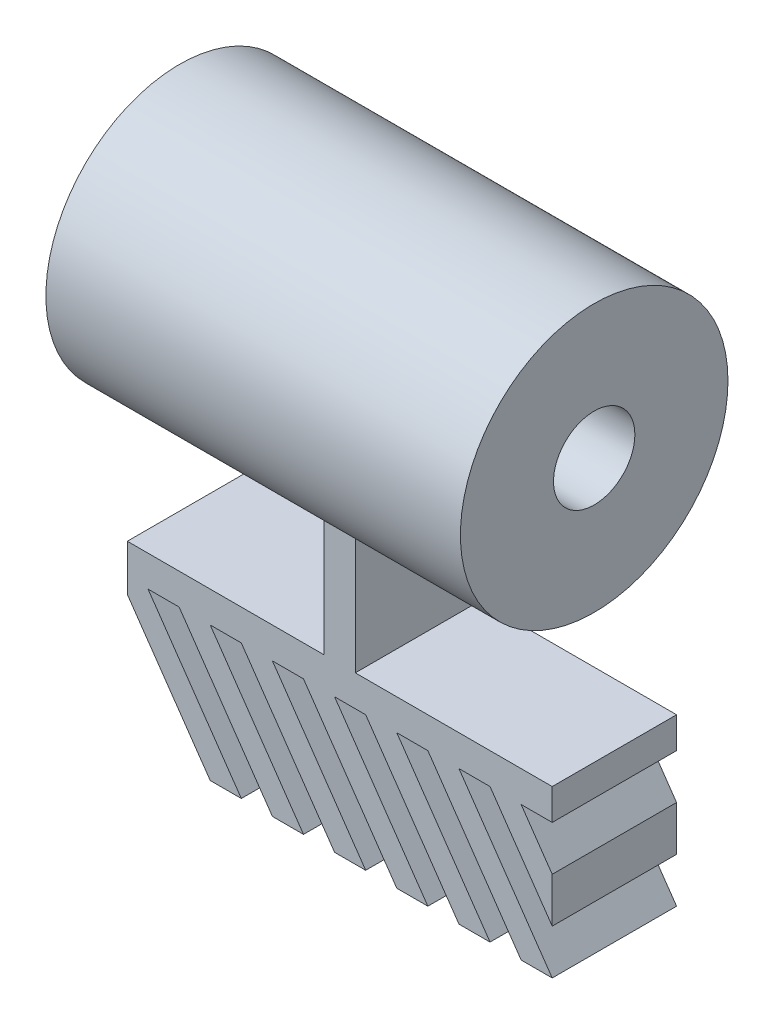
ISO-10303-21;
HEADER;
FILE_DESCRIPTION(('STEP AP214'),'2;1');
FILE_NAME('part.step','',(''),(''),'','','');
FILE_SCHEMA(('AUTOMOTIVE_DESIGN { 1 0 10303 214 1 1 1 1 }'));
ENDSEC;
DATA;
#1=APPLICATION_CONTEXT('core data for automotive mechanical design processes');
#2=APPLICATION_PROTOCOL_DEFINITION('international standard','automotive_design',2000,#1);
#3=PRODUCT_CONTEXT('',#1,'mechanical');
#4=PRODUCT('Part','Part','',(#3));
#5=PRODUCT_RELATED_PRODUCT_CATEGORY('part','',(#4));
#6=PRODUCT_DEFINITION_FORMATION('','',#4);
#7=PRODUCT_DEFINITION_CONTEXT('part definition',#1,'design');
#8=PRODUCT_DEFINITION('design','',#6,#7);
#9=PRODUCT_DEFINITION_SHAPE('','',#8);
#10=(LENGTH_UNIT() NAMED_UNIT(*) SI_UNIT(.MILLI.,.METRE.));
#11=(NAMED_UNIT(*) PLANE_ANGLE_UNIT() SI_UNIT($,.RADIAN.));
#12=(NAMED_UNIT(*) SI_UNIT($,.STERADIAN.) SOLID_ANGLE_UNIT());
#13=UNCERTAINTY_MEASURE_WITH_UNIT(LENGTH_MEASURE(1.E-05),#10,'distance_accuracy_value','');
#14=(GEOMETRIC_REPRESENTATION_CONTEXT(3) GLOBAL_UNCERTAINTY_ASSIGNED_CONTEXT((#13)) GLOBAL_UNIT_ASSIGNED_CONTEXT((#10,
#11,#12)) REPRESENTATION_CONTEXT('',''));
#15=CARTESIAN_POINT('',(0.,0.,0.));
#16=DIRECTION('',(0.,0.,1.));
#17=DIRECTION('',(1.,0.,0.));
#18=AXIS2_PLACEMENT_3D('',#15,#16,#17);
#19=CARTESIAN_POINT('',(-100.,-152.602639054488,0.));
#20=DIRECTION('',(1.,0.,0.));
#21=DIRECTION('',(0.,0.,-1.));
#22=AXIS2_PLACEMENT_3D('',#19,#20,#21);
#23=CYLINDRICAL_SURFACE('',#22,64.5447532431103);
#24=CARTESIAN_POINT('',(14.7507159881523,-152.602639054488,0.));
#25=DIRECTION('',(1.,0.,0.));
#26=DIRECTION('',(0.,1.,0.));
#27=AXIS2_PLACEMENT_3D('',#24,#25,#26);
#28=CIRCLE('',#27,64.5447532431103);
#29=CARTESIAN_POINT('',(14.7507159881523,-209.751787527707,30.));
#30=VERTEX_POINT('',#29);
#31=CARTESIAN_POINT('',(14.7507159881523,-209.751787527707,-30.));
#32=VERTEX_POINT('',#31);
#33=EDGE_CURVE('E256',#30,#32,#28,.T.);
#34=ORIENTED_EDGE('',*,*,#33,.T.);
#35=DIRECTION('',(1.,0.,0.));
#36=VECTOR('',#35,1.);
#37=CARTESIAN_POINT('',(-100.,-209.751787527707,-30.));
#38=LINE('',#37,#36);
#39=CARTESIAN_POINT('',(-0.249284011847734,-209.751787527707,-30.));
#40=VERTEX_POINT('',#39);
#41=EDGE_CURVE('E455',#32,#40,#38,.F.);
#42=ORIENTED_EDGE('',*,*,#41,.T.);
#43=CARTESIAN_POINT('',(-0.249284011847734,-152.602639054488,0.));
#44=DIRECTION('',(-1.,0.,0.));
#45=DIRECTION('',(0.,0.,1.));
#46=AXIS2_PLACEMENT_3D('',#43,#44,#45);
#47=CIRCLE('',#46,64.5447532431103);
#48=CARTESIAN_POINT('',(-0.249284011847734,-209.751787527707,30.));
#49=VERTEX_POINT('',#48);
#50=EDGE_CURVE('E46',#40,#49,#47,.T.);
#51=ORIENTED_EDGE('',*,*,#50,.T.);
#52=DIRECTION('',(1.,0.,0.));
#53=VECTOR('',#52,1.);
#54=CARTESIAN_POINT('',(-100.,-209.751787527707,30.));
#55=LINE('',#54,#53);
#56=EDGE_CURVE('E11',#30,#49,#55,.F.);
#57=ORIENTED_EDGE('',*,*,#56,.F.);
#58=EDGE_LOOP('',(#34,#42,#51,#57));
#59=FACE_BOUND('',#58,.T.);
#60=CARTESIAN_POINT('',(-100.,-152.602639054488,0.));
#61=DIRECTION('',(1.,0.,0.));
#62=DIRECTION('',(0.,0.,-1.));
#63=AXIS2_PLACEMENT_3D('',#60,#61,#62);
#64=CIRCLE('',#63,64.5447532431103);
#65=CARTESIAN_POINT('',(-100.,-152.602639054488,-64.5447532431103));
#66=VERTEX_POINT('',#65);
#67=EDGE_CURVE('E264',#66,#66,#64,.T.);
#68=ORIENTED_EDGE('',*,*,#67,.T.);
#69=EDGE_LOOP('',(#68));
#70=FACE_BOUND('',#69,.T.);
#71=CARTESIAN_POINT('',(100.,-152.602639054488,0.));
#72=DIRECTION('',(1.,0.,0.));
#73=DIRECTION('',(0.,0.,-1.));
#74=AXIS2_PLACEMENT_3D('',#71,#72,#73);
#75=CIRCLE('',#74,64.5447532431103);
#76=CARTESIAN_POINT('',(100.,-152.602639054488,-64.5447532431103));
#77=VERTEX_POINT('',#76);
#78=EDGE_CURVE('E992',#77,#77,#75,.T.);
#79=ORIENTED_EDGE('',*,*,#78,.F.);
#80=EDGE_LOOP('',(#79));
#81=FACE_BOUND('',#80,.T.);
#82=ADVANCED_FACE('F31',(#59,#70,#81),#23,.T.);
#83=CARTESIAN_POINT('',(-100.,-152.602639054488,0.));
#84=DIRECTION('',(1.,0.,0.));
#85=DIRECTION('',(0.,0.,-1.));
#86=AXIS2_PLACEMENT_3D('',#83,#84,#85);
#87=PLANE('',#86);
#88=CARTESIAN_POINT('',(-100.,-152.602639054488,0.));
#89=DIRECTION('',(1.,0.,0.));
#90=DIRECTION('',(0.,0.,-1.));
#91=AXIS2_PLACEMENT_3D('',#88,#89,#90);
#92=CIRCLE('',#91,19.6271342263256);
#93=CARTESIAN_POINT('',(-100.,-152.602639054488,-19.6271342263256));
#94=VERTEX_POINT('',#93);
#95=EDGE_CURVE('E998',#94,#94,#92,.T.);
#96=ORIENTED_EDGE('',*,*,#95,.T.);
#97=EDGE_LOOP('',(#96));
#98=FACE_BOUND('',#97,.T.);
#99=ORIENTED_EDGE('',*,*,#67,.F.);
#100=EDGE_LOOP('',(#99));
#101=FACE_BOUND('',#100,.T.);
#102=ADVANCED_FACE('F673',(#98,#101),#87,.F.);
#103=CARTESIAN_POINT('',(-100.,-152.602639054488,0.));
#104=DIRECTION('',(1.,0.,0.));
#105=DIRECTION('',(0.,0.,-1.));
#106=AXIS2_PLACEMENT_3D('',#103,#104,#105);
#107=CYLINDRICAL_SURFACE('',#106,19.6271342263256);
#108=ORIENTED_EDGE('',*,*,#95,.F.);
#109=EDGE_LOOP('',(#108));
#110=FACE_BOUND('',#109,.T.);
#111=CARTESIAN_POINT('',(100.,-152.602639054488,0.));
#112=DIRECTION('',(1.,0.,0.));
#113=DIRECTION('',(0.,0.,-1.));
#114=AXIS2_PLACEMENT_3D('',#111,#112,#113);
#115=CIRCLE('',#114,19.6271342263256);
#116=CARTESIAN_POINT('',(100.,-152.602639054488,-19.6271342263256));
#117=VERTEX_POINT('',#116);
#118=EDGE_CURVE('E995',#117,#117,#115,.T.);
#119=ORIENTED_EDGE('',*,*,#118,.T.);
#120=EDGE_LOOP('',(#119));
#121=FACE_BOUND('',#120,.T.);
#122=ADVANCED_FACE('F678',(#110,#121),#107,.F.);
#123=CARTESIAN_POINT('',(100.,-152.602639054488,0.));
#124=DIRECTION('',(1.,0.,0.));
#125=DIRECTION('',(0.,0.,-1.));
#126=AXIS2_PLACEMENT_3D('',#123,#124,#125);
#127=PLANE('',#126);
#128=ORIENTED_EDGE('',*,*,#78,.T.);
#129=EDGE_LOOP('',(#128));
#130=FACE_BOUND('',#129,.T.);
#131=ORIENTED_EDGE('',*,*,#118,.F.);
#132=EDGE_LOOP('',(#131));
#133=FACE_BOUND('',#132,.T.);
#134=ADVANCED_FACE('F785',(#130,#133),#127,.T.);
#135=CARTESIAN_POINT('',(-0.249284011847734,-270.00000000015,-30.));
#136=DIRECTION('',(-1.,0.,0.));
#137=DIRECTION('',(0.,0.,1.));
#138=AXIS2_PLACEMENT_3D('',#135,#136,#137);
#139=PLANE('',#138);
#140=ORIENTED_EDGE('',*,*,#50,.F.);
#141=DIRECTION('',(0.,-1.,0.));
#142=VECTOR('',#141,1.);
#143=CARTESIAN_POINT('',(-0.249284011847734,-270.00000000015,-30.));
#144=LINE('',#143,#142);
#145=CARTESIAN_POINT('',(-0.249284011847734,-270.00000000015,-30.));
#146=VERTEX_POINT('',#145);
#147=EDGE_CURVE('E271',#40,#146,#144,.T.);
#148=ORIENTED_EDGE('',*,*,#147,.T.);
#149=DIRECTION('',(0.,0.,1.));
#150=VECTOR('',#149,1.);
#151=CARTESIAN_POINT('',(-0.249284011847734,-270.00000000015,-30.));
#152=LINE('',#151,#150);
#153=CARTESIAN_POINT('',(-0.249284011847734,-270.00000000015,30.));
#154=VERTEX_POINT('',#153);
#155=EDGE_CURVE('E375',#146,#154,#152,.T.);
#156=ORIENTED_EDGE('',*,*,#155,.T.);
#157=DIRECTION('',(0.,-1.,0.));
#158=VECTOR('',#157,1.);
#159=CARTESIAN_POINT('',(-0.249284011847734,-270.00000000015,30.));
#160=LINE('',#159,#158);
#161=EDGE_CURVE('E442',#49,#154,#160,.T.);
#162=ORIENTED_EDGE('',*,*,#161,.F.);
#163=EDGE_LOOP('',(#140,#148,#156,#162));
#164=FACE_BOUND('',#163,.T.);
#165=ADVANCED_FACE('F33',(#164),#139,.T.);
#166=CARTESIAN_POINT('',(14.7507159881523,-200.00000000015,-30.));
#167=DIRECTION('',(1.,0.,0.));
#168=DIRECTION('',(0.,1.,0.));
#169=AXIS2_PLACEMENT_3D('',#166,#167,#168);
#170=PLANE('',#169);
#171=ORIENTED_EDGE('',*,*,#33,.F.);
#172=DIRECTION('',(0.,1.,0.));
#173=VECTOR('',#172,1.);
#174=CARTESIAN_POINT('',(14.7507159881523,-200.00000000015,30.));
#175=LINE('',#174,#173);
#176=CARTESIAN_POINT('',(14.7507159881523,-270.00000000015,30.));
#177=VERTEX_POINT('',#176);
#178=EDGE_CURVE('E262',#177,#30,#175,.T.);
#179=ORIENTED_EDGE('',*,*,#178,.F.);
#180=DIRECTION('',(0.,0.,1.));
#181=VECTOR('',#180,1.);
#182=CARTESIAN_POINT('',(14.7507159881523,-270.00000000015,-30.));
#183=LINE('',#182,#181);
#184=CARTESIAN_POINT('',(14.7507159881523,-270.00000000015,-30.));
#185=VERTEX_POINT('',#184);
#186=EDGE_CURVE('E39',#185,#177,#183,.T.);
#187=ORIENTED_EDGE('',*,*,#186,.F.);
#188=DIRECTION('',(0.,1.,0.));
#189=VECTOR('',#188,1.);
#190=CARTESIAN_POINT('',(14.7507159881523,-200.00000000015,-30.));
#191=LINE('',#190,#189);
#192=EDGE_CURVE('E263',#185,#32,#191,.T.);
#193=ORIENTED_EDGE('',*,*,#192,.T.);
#194=EDGE_LOOP('',(#171,#179,#187,#193));
#195=FACE_BOUND('',#194,.T.);
#196=ADVANCED_FACE('F261',(#195),#170,.T.);
#197=CARTESIAN_POINT('',(14.7507159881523,-270.00000000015,-30.));
#198=DIRECTION('',(0.,1.,0.));
#199=DIRECTION('',(0.,0.,1.));
#200=AXIS2_PLACEMENT_3D('',#197,#198,#199);
#201=PLANE('',#200);
#202=ORIENTED_EDGE('',*,*,#186,.T.);
#203=DIRECTION('',(-1.,0.,0.));
#204=VECTOR('',#203,1.);
#205=CARTESIAN_POINT('',(14.7507159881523,-270.00000000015,30.));
#206=LINE('',#205,#204);
#207=CARTESIAN_POINT('',(109.750715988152,-270.00000000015,30.));
#208=VERTEX_POINT('',#207);
#209=EDGE_CURVE('E270',#208,#177,#206,.T.);
#210=ORIENTED_EDGE('',*,*,#209,.F.);
#211=DIRECTION('',(0.,0.,1.));
#212=VECTOR('',#211,1.);
#213=CARTESIAN_POINT('',(109.750715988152,-270.00000000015,-30.));
#214=LINE('',#213,#212);
#215=CARTESIAN_POINT('',(109.750715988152,-270.00000000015,-30.));
#216=VERTEX_POINT('',#215);
#217=EDGE_CURVE('E377',#216,#208,#214,.T.);
#218=ORIENTED_EDGE('',*,*,#217,.F.);
#219=DIRECTION('',(-1.,0.,0.));
#220=VECTOR('',#219,1.);
#221=CARTESIAN_POINT('',(14.7507159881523,-270.00000000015,-30.));
#222=LINE('',#221,#220);
#223=EDGE_CURVE('E371',#216,#185,#222,.T.);
#224=ORIENTED_EDGE('',*,*,#223,.T.);
#225=EDGE_LOOP('',(#202,#210,#218,#224));
#226=FACE_BOUND('',#225,.T.);
#227=ADVANCED_FACE('F545',(#226),#201,.T.);
#228=CARTESIAN_POINT('',(109.750715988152,-270.00000000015,-30.));
#229=DIRECTION('',(1.,0.,0.));
#230=DIRECTION('',(0.,0.,-1.));
#231=AXIS2_PLACEMENT_3D('',#228,#229,#230);
#232=PLANE('',#231);
#233=ORIENTED_EDGE('',*,*,#217,.T.);
#234=DIRECTION('',(0.,1.,0.));
#235=VECTOR('',#234,1.);
#236=CARTESIAN_POINT('',(109.750715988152,-270.00000000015,30.));
#237=LINE('',#236,#235);
#238=CARTESIAN_POINT('',(109.750715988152,-285.00000000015,30.));
#239=VERTEX_POINT('',#238);
#240=EDGE_CURVE('E275',#239,#208,#237,.T.);
#241=ORIENTED_EDGE('',*,*,#240,.F.);
#242=DIRECTION('',(0.,0.,1.));
#243=VECTOR('',#242,1.);
#244=CARTESIAN_POINT('',(109.750715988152,-285.00000000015,-30.));
#245=LINE('',#244,#243);
#246=CARTESIAN_POINT('',(109.750715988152,-285.00000000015,-30.));
#247=VERTEX_POINT('',#246);
#248=EDGE_CURVE('E379',#247,#239,#245,.T.);
#249=ORIENTED_EDGE('',*,*,#248,.F.);
#250=DIRECTION('',(0.,1.,0.));
#251=VECTOR('',#250,1.);
#252=CARTESIAN_POINT('',(109.750715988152,-270.00000000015,-30.));
#253=LINE('',#252,#251);
#254=EDGE_CURVE('E368',#247,#216,#253,.T.);
#255=ORIENTED_EDGE('',*,*,#254,.T.);
#256=EDGE_LOOP('',(#233,#241,#249,#255));
#257=FACE_BOUND('',#256,.T.);
#258=ADVANCED_FACE('F551',(#257),#232,.T.);
#259=CARTESIAN_POINT('',(109.750715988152,-285.00000000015,-30.));
#260=DIRECTION('',(0.,-1.,0.));
#261=DIRECTION('',(0.,0.,-1.));
#262=AXIS2_PLACEMENT_3D('',#259,#260,#261);
#263=PLANE('',#262);
#264=ORIENTED_EDGE('',*,*,#248,.T.);
#265=DIRECTION('',(1.,0.,0.));
#266=VECTOR('',#265,1.);
#267=CARTESIAN_POINT('',(109.750715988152,-285.00000000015,30.));
#268=LINE('',#267,#266);
#269=CARTESIAN_POINT('',(94.7507159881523,-285.00000000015,30.));
#270=VERTEX_POINT('',#269);
#271=EDGE_CURVE('E539',#270,#239,#268,.T.);
#272=ORIENTED_EDGE('',*,*,#271,.F.);
#273=DIRECTION('',(0.,0.,1.));
#274=VECTOR('',#273,1.);
#275=CARTESIAN_POINT('',(94.7507159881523,-285.00000000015,-30.));
#276=LINE('',#275,#274);
#277=CARTESIAN_POINT('',(94.7507159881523,-285.00000000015,-30.));
#278=VERTEX_POINT('',#277);
#279=EDGE_CURVE('E381',#278,#270,#276,.T.);
#280=ORIENTED_EDGE('',*,*,#279,.F.);
#281=DIRECTION('',(1.,0.,0.));
#282=VECTOR('',#281,1.);
#283=CARTESIAN_POINT('',(109.750715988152,-285.00000000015,-30.));
#284=LINE('',#283,#282);
#285=EDGE_CURVE('E365',#278,#247,#284,.T.);
#286=ORIENTED_EDGE('',*,*,#285,.T.);
#287=EDGE_LOOP('',(#264,#272,#280,#286));
#288=FACE_BOUND('',#287,.T.);
#289=ADVANCED_FACE('F553',(#288),#263,.T.);
#290=CARTESIAN_POINT('',(94.7507159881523,-285.00000000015,-30.));
#291=DIRECTION('',(0.822192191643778,0.569209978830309,0.));
#292=DIRECTION('',(-0.569209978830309,0.822192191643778,0.));
#293=AXIS2_PLACEMENT_3D('',#290,#291,#292);
#294=PLANE('',#293);
#295=ORIENTED_EDGE('',*,*,#279,.T.);
#296=DIRECTION('',(-0.569209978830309,0.822192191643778,0.));
#297=VECTOR('',#296,1.);
#298=CARTESIAN_POINT('',(94.7507159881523,-285.00000000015,30.));
#299=LINE('',#298,#297);
#300=CARTESIAN_POINT('',(109.750715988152,-306.666666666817,30.));
#301=VERTEX_POINT('',#300);
#302=EDGE_CURVE('E536',#301,#270,#299,.T.);
#303=ORIENTED_EDGE('',*,*,#302,.F.);
#304=DIRECTION('',(0.,0.,1.));
#305=VECTOR('',#304,1.);
#306=CARTESIAN_POINT('',(109.750715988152,-306.666666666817,-30.));
#307=LINE('',#306,#305);
#308=CARTESIAN_POINT('',(109.750715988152,-306.666666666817,-30.));
#309=VERTEX_POINT('',#308);
#310=EDGE_CURVE('E383',#309,#301,#307,.T.);
#311=ORIENTED_EDGE('',*,*,#310,.F.);
#312=DIRECTION('',(-0.569209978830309,0.822192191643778,0.));
#313=VECTOR('',#312,1.);
#314=CARTESIAN_POINT('',(94.7507159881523,-285.00000000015,-30.));
#315=LINE('',#314,#313);
#316=EDGE_CURVE('E362',#309,#278,#315,.T.);
#317=ORIENTED_EDGE('',*,*,#316,.T.);
#318=EDGE_LOOP('',(#295,#303,#311,#317));
#319=FACE_BOUND('',#318,.T.);
#320=ADVANCED_FACE('F557',(#319),#294,.T.);
#321=CARTESIAN_POINT('',(109.750715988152,-306.666666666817,-30.));
#322=DIRECTION('',(1.,0.,0.));
#323=DIRECTION('',(0.,0.,-1.));
#324=AXIS2_PLACEMENT_3D('',#321,#322,#323);
#325=PLANE('',#324);
#326=ORIENTED_EDGE('',*,*,#310,.T.);
#327=DIRECTION('',(0.,1.,0.));
#328=VECTOR('',#327,1.);
#329=CARTESIAN_POINT('',(109.750715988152,-306.666666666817,30.));
#330=LINE('',#329,#328);
#331=CARTESIAN_POINT('',(109.750715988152,-328.333333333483,30.));
#332=VERTEX_POINT('',#331);
#333=EDGE_CURVE('E533',#332,#301,#330,.T.);
#334=ORIENTED_EDGE('',*,*,#333,.F.);
#335=DIRECTION('',(0.,0.,1.));
#336=VECTOR('',#335,1.);
#337=CARTESIAN_POINT('',(109.750715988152,-328.333333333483,-30.));
#338=LINE('',#337,#336);
#339=CARTESIAN_POINT('',(109.750715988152,-328.333333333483,-30.));
#340=VERTEX_POINT('',#339);
#341=EDGE_CURVE('E385',#340,#332,#338,.T.);
#342=ORIENTED_EDGE('',*,*,#341,.F.);
#343=DIRECTION('',(0.,1.,0.));
#344=VECTOR('',#343,1.);
#345=CARTESIAN_POINT('',(109.750715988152,-306.666666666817,-30.));
#346=LINE('',#345,#344);
#347=EDGE_CURVE('E359',#340,#309,#346,.T.);
#348=ORIENTED_EDGE('',*,*,#347,.T.);
#349=EDGE_LOOP('',(#326,#334,#342,#348));
#350=FACE_BOUND('',#349,.T.);
#351=ADVANCED_FACE('F561',(#350),#325,.T.);
#352=CARTESIAN_POINT('',(109.750715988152,-328.333333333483,-30.));
#353=DIRECTION('',(-0.822192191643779,-0.569209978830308,0.));
#354=DIRECTION('',(0.569209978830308,-0.822192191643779,0.));
#355=AXIS2_PLACEMENT_3D('',#352,#353,#354);
#356=PLANE('',#355);
#357=ORIENTED_EDGE('',*,*,#341,.T.);
#358=DIRECTION('',(0.569209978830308,-0.822192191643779,0.));
#359=VECTOR('',#358,1.);
#360=CARTESIAN_POINT('',(109.750715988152,-328.333333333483,30.));
#361=LINE('',#360,#359);
#362=CARTESIAN_POINT('',(79.7507159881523,-285.00000000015,30.));
#363=VERTEX_POINT('',#362);
#364=EDGE_CURVE('E530',#363,#332,#361,.T.);
#365=ORIENTED_EDGE('',*,*,#364,.F.);
#366=DIRECTION('',(0.,0.,1.));
#367=VECTOR('',#366,1.);
#368=CARTESIAN_POINT('',(79.7507159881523,-285.00000000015,-30.));
#369=LINE('',#368,#367);
#370=CARTESIAN_POINT('',(79.7507159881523,-285.00000000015,-30.));
#371=VERTEX_POINT('',#370);
#372=EDGE_CURVE('E387',#371,#363,#369,.T.);
#373=ORIENTED_EDGE('',*,*,#372,.F.);
#374=DIRECTION('',(0.569209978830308,-0.822192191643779,0.));
#375=VECTOR('',#374,1.);
#376=CARTESIAN_POINT('',(109.750715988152,-328.333333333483,-30.));
#377=LINE('',#376,#375);
#378=EDGE_CURVE('E356',#371,#340,#377,.T.);
#379=ORIENTED_EDGE('',*,*,#378,.T.);
#380=EDGE_LOOP('',(#357,#365,#373,#379));
#381=FACE_BOUND('',#380,.T.);
#382=ADVANCED_FACE('F565',(#381),#356,.T.);
#383=CARTESIAN_POINT('',(79.7507159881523,-285.00000000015,-30.));
#384=DIRECTION('',(0.,-1.,0.));
#385=DIRECTION('',(0.,0.,-1.));
#386=AXIS2_PLACEMENT_3D('',#383,#384,#385);
#387=PLANE('',#386);
#388=ORIENTED_EDGE('',*,*,#372,.T.);
#389=DIRECTION('',(1.,0.,0.));
#390=VECTOR('',#389,1.);
#391=CARTESIAN_POINT('',(79.7507159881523,-285.00000000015,30.));
#392=LINE('',#391,#390);
#393=CARTESIAN_POINT('',(64.7507159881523,-285.00000000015,30.));
#394=VERTEX_POINT('',#393);
#395=EDGE_CURVE('E527',#394,#363,#392,.T.);
#396=ORIENTED_EDGE('',*,*,#395,.F.);
#397=DIRECTION('',(0.,0.,1.));
#398=VECTOR('',#397,1.);
#399=CARTESIAN_POINT('',(64.7507159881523,-285.00000000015,-30.));
#400=LINE('',#399,#398);
#401=CARTESIAN_POINT('',(64.7507159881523,-285.00000000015,-30.));
#402=VERTEX_POINT('',#401);
#403=EDGE_CURVE('E389',#402,#394,#400,.T.);
#404=ORIENTED_EDGE('',*,*,#403,.F.);
#405=DIRECTION('',(1.,0.,0.));
#406=VECTOR('',#405,1.);
#407=CARTESIAN_POINT('',(79.7507159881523,-285.00000000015,-30.));
#408=LINE('',#407,#406);
#409=EDGE_CURVE('E353',#402,#371,#408,.T.);
#410=ORIENTED_EDGE('',*,*,#409,.T.);
#411=EDGE_LOOP('',(#388,#396,#404,#410));
#412=FACE_BOUND('',#411,.T.);
#413=ADVANCED_FACE('F570',(#412),#387,.T.);
#414=CARTESIAN_POINT('',(64.7507159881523,-285.00000000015,-30.));
#415=DIRECTION('',(0.822192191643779,0.569209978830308,0.));
#416=DIRECTION('',(-0.569209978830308,0.822192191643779,0.));
#417=AXIS2_PLACEMENT_3D('',#414,#415,#416);
#418=PLANE('',#417);
#419=ORIENTED_EDGE('',*,*,#403,.T.);
#420=DIRECTION('',(-0.569209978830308,0.822192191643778,0.));
#421=VECTOR('',#420,1.);
#422=CARTESIAN_POINT('',(64.7507159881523,-285.00000000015,30.));
#423=LINE('',#422,#421);
#424=CARTESIAN_POINT('',(109.750715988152,-350.00000000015,30.));
#425=VERTEX_POINT('',#424);
#426=EDGE_CURVE('E524',#425,#394,#423,.T.);
#427=ORIENTED_EDGE('',*,*,#426,.F.);
#428=DIRECTION('',(0.,0.,1.));
#429=VECTOR('',#428,1.);
#430=CARTESIAN_POINT('',(109.750715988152,-350.00000000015,-30.));
#431=LINE('',#430,#429);
#432=CARTESIAN_POINT('',(109.750715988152,-350.00000000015,-30.));
#433=VERTEX_POINT('',#432);
#434=EDGE_CURVE('E391',#433,#425,#431,.T.);
#435=ORIENTED_EDGE('',*,*,#434,.F.);
#436=DIRECTION('',(-0.569209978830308,0.822192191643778,0.));
#437=VECTOR('',#436,1.);
#438=CARTESIAN_POINT('',(64.7507159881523,-285.00000000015,-30.));
#439=LINE('',#438,#437);
#440=EDGE_CURVE('E350',#433,#402,#439,.T.);
#441=ORIENTED_EDGE('',*,*,#440,.T.);
#442=EDGE_LOOP('',(#419,#427,#435,#441));
#443=FACE_BOUND('',#442,.T.);
#444=ADVANCED_FACE('F573',(#443),#418,.T.);
#445=CARTESIAN_POINT('',(109.750715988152,-350.00000000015,-30.));
#446=DIRECTION('',(0.,-1.,0.));
#447=DIRECTION('',(0.,0.,-1.));
#448=AXIS2_PLACEMENT_3D('',#445,#446,#447);
#449=PLANE('',#448);
#450=ORIENTED_EDGE('',*,*,#434,.T.);
#451=DIRECTION('',(1.,0.,0.));
#452=VECTOR('',#451,1.);
#453=CARTESIAN_POINT('',(109.750715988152,-350.00000000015,30.));
#454=LINE('',#453,#452);
#455=CARTESIAN_POINT('',(94.7507159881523,-350.00000000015,30.));
#456=VERTEX_POINT('',#455);
#457=EDGE_CURVE('E521',#456,#425,#454,.T.);
#458=ORIENTED_EDGE('',*,*,#457,.F.);
#459=DIRECTION('',(0.,0.,1.));
#460=VECTOR('',#459,1.);
#461=CARTESIAN_POINT('',(94.7507159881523,-350.00000000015,-30.));
#462=LINE('',#461,#460);
#463=CARTESIAN_POINT('',(94.7507159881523,-350.00000000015,-30.));
#464=VERTEX_POINT('',#463);
#465=EDGE_CURVE('E393',#464,#456,#462,.T.);
#466=ORIENTED_EDGE('',*,*,#465,.F.);
#467=DIRECTION('',(1.,0.,0.));
#468=VECTOR('',#467,1.);
#469=CARTESIAN_POINT('',(109.750715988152,-350.00000000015,-30.));
#470=LINE('',#469,#468);
#471=EDGE_CURVE('E347',#464,#433,#470,.T.);
#472=ORIENTED_EDGE('',*,*,#471,.T.);
#473=EDGE_LOOP('',(#450,#458,#466,#472));
#474=FACE_BOUND('',#473,.T.);
#475=ADVANCED_FACE('F577',(#474),#449,.T.);
#476=CARTESIAN_POINT('',(94.7507159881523,-350.00000000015,-30.));
#477=DIRECTION('',(-0.822192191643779,-0.569209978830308,0.));
#478=DIRECTION('',(0.569209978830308,-0.822192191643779,0.));
#479=AXIS2_PLACEMENT_3D('',#476,#477,#478);
#480=PLANE('',#479);
#481=ORIENTED_EDGE('',*,*,#465,.T.);
#482=DIRECTION('',(0.569209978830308,-0.822192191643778,0.));
#483=VECTOR('',#482,1.);
#484=CARTESIAN_POINT('',(94.7507159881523,-350.00000000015,30.));
#485=LINE('',#484,#483);
#486=CARTESIAN_POINT('',(49.7507159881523,-285.00000000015,30.));
#487=VERTEX_POINT('',#486);
#488=EDGE_CURVE('E518',#487,#456,#485,.T.);
#489=ORIENTED_EDGE('',*,*,#488,.F.);
#490=DIRECTION('',(0.,0.,1.));
#491=VECTOR('',#490,1.);
#492=CARTESIAN_POINT('',(49.7507159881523,-285.00000000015,-30.));
#493=LINE('',#492,#491);
#494=CARTESIAN_POINT('',(49.7507159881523,-285.00000000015,-30.));
#495=VERTEX_POINT('',#494);
#496=EDGE_CURVE('E395',#495,#487,#493,.T.);
#497=ORIENTED_EDGE('',*,*,#496,.F.);
#498=DIRECTION('',(0.569209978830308,-0.822192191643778,0.));
#499=VECTOR('',#498,1.);
#500=CARTESIAN_POINT('',(94.7507159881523,-350.00000000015,-30.));
#501=LINE('',#500,#499);
#502=EDGE_CURVE('E344',#495,#464,#501,.T.);
#503=ORIENTED_EDGE('',*,*,#502,.T.);
#504=EDGE_LOOP('',(#481,#489,#497,#503));
#505=FACE_BOUND('',#504,.T.);
#506=ADVANCED_FACE('F582',(#505),#480,.T.);
#507=CARTESIAN_POINT('',(49.7507159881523,-285.00000000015,-30.));
#508=DIRECTION('',(0.,-1.,0.));
#509=DIRECTION('',(0.,0.,-1.));
#510=AXIS2_PLACEMENT_3D('',#507,#508,#509);
#511=PLANE('',#510);
#512=ORIENTED_EDGE('',*,*,#496,.T.);
#513=DIRECTION('',(1.,0.,0.));
#514=VECTOR('',#513,1.);
#515=CARTESIAN_POINT('',(49.7507159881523,-285.00000000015,30.));
#516=LINE('',#515,#514);
#517=CARTESIAN_POINT('',(34.7507159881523,-285.00000000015,30.));
#518=VERTEX_POINT('',#517);
#519=EDGE_CURVE('E515',#518,#487,#516,.T.);
#520=ORIENTED_EDGE('',*,*,#519,.F.);
#521=DIRECTION('',(0.,0.,1.));
#522=VECTOR('',#521,1.);
#523=CARTESIAN_POINT('',(34.7507159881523,-285.00000000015,-30.));
#524=LINE('',#523,#522);
#525=CARTESIAN_POINT('',(34.7507159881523,-285.00000000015,-30.));
#526=VERTEX_POINT('',#525);
#527=EDGE_CURVE('E397',#526,#518,#524,.T.);
#528=ORIENTED_EDGE('',*,*,#527,.F.);
#529=DIRECTION('',(1.,0.,0.));
#530=VECTOR('',#529,1.);
#531=CARTESIAN_POINT('',(49.7507159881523,-285.00000000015,-30.));
#532=LINE('',#531,#530);
#533=EDGE_CURVE('E341',#526,#495,#532,.T.);
#534=ORIENTED_EDGE('',*,*,#533,.T.);
#535=EDGE_LOOP('',(#512,#520,#528,#534));
#536=FACE_BOUND('',#535,.T.);
#537=ADVANCED_FACE('F585',(#536),#511,.T.);
#538=CARTESIAN_POINT('',(34.7507159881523,-285.00000000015,-30.));
#539=DIRECTION('',(0.822192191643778,0.569209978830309,0.));
#540=DIRECTION('',(-0.569209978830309,0.822192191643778,0.));
#541=AXIS2_PLACEMENT_3D('',#538,#539,#540);
#542=PLANE('',#541);
#543=ORIENTED_EDGE('',*,*,#527,.T.);
#544=DIRECTION('',(-0.569209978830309,0.822192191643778,0.));
#545=VECTOR('',#544,1.);
#546=CARTESIAN_POINT('',(34.7507159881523,-285.00000000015,30.));
#547=LINE('',#546,#545);
#548=CARTESIAN_POINT('',(79.7507159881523,-350.00000000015,30.));
#549=VERTEX_POINT('',#548);
#550=EDGE_CURVE('E512',#549,#518,#547,.T.);
#551=ORIENTED_EDGE('',*,*,#550,.F.);
#552=DIRECTION('',(0.,0.,1.));
#553=VECTOR('',#552,1.);
#554=CARTESIAN_POINT('',(79.7507159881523,-350.00000000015,-30.));
#555=LINE('',#554,#553);
#556=CARTESIAN_POINT('',(79.7507159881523,-350.00000000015,-30.));
#557=VERTEX_POINT('',#556);
#558=EDGE_CURVE('E399',#557,#549,#555,.T.);
#559=ORIENTED_EDGE('',*,*,#558,.F.);
#560=DIRECTION('',(-0.569209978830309,0.822192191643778,0.));
#561=VECTOR('',#560,1.);
#562=CARTESIAN_POINT('',(34.7507159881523,-285.00000000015,-30.));
#563=LINE('',#562,#561);
#564=EDGE_CURVE('E338',#557,#526,#563,.T.);
#565=ORIENTED_EDGE('',*,*,#564,.T.);
#566=EDGE_LOOP('',(#543,#551,#559,#565));
#567=FACE_BOUND('',#566,.T.);
#568=ADVANCED_FACE('F589',(#567),#542,.T.);
#569=CARTESIAN_POINT('',(79.7507159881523,-350.00000000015,-30.));
#570=DIRECTION('',(0.,-1.,0.));
#571=DIRECTION('',(0.,0.,-1.));
#572=AXIS2_PLACEMENT_3D('',#569,#570,#571);
#573=PLANE('',#572);
#574=ORIENTED_EDGE('',*,*,#558,.T.);
#575=DIRECTION('',(1.,0.,0.));
#576=VECTOR('',#575,1.);
#577=CARTESIAN_POINT('',(79.7507159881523,-350.00000000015,30.));
#578=LINE('',#577,#576);
#579=CARTESIAN_POINT('',(64.7507159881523,-350.00000000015,30.));
#580=VERTEX_POINT('',#579);
#581=EDGE_CURVE('E509',#580,#549,#578,.T.);
#582=ORIENTED_EDGE('',*,*,#581,.F.);
#583=DIRECTION('',(0.,0.,1.));
#584=VECTOR('',#583,1.);
#585=CARTESIAN_POINT('',(64.7507159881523,-350.00000000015,-30.));
#586=LINE('',#585,#584);
#587=CARTESIAN_POINT('',(64.7507159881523,-350.00000000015,-30.));
#588=VERTEX_POINT('',#587);
#589=EDGE_CURVE('E401',#588,#580,#586,.T.);
#590=ORIENTED_EDGE('',*,*,#589,.F.);
#591=DIRECTION('',(1.,0.,0.));
#592=VECTOR('',#591,1.);
#593=CARTESIAN_POINT('',(79.7507159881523,-350.00000000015,-30.));
#594=LINE('',#593,#592);
#595=EDGE_CURVE('E335',#588,#557,#594,.T.);
#596=ORIENTED_EDGE('',*,*,#595,.T.);
#597=EDGE_LOOP('',(#574,#582,#590,#596));
#598=FACE_BOUND('',#597,.T.);
#599=ADVANCED_FACE('F594',(#598),#573,.T.);
#600=CARTESIAN_POINT('',(64.7507159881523,-350.00000000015,-30.));
#601=DIRECTION('',(-0.822192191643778,-0.569209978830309,0.));
#602=DIRECTION('',(0.569209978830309,-0.822192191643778,0.));
#603=AXIS2_PLACEMENT_3D('',#600,#601,#602);
#604=PLANE('',#603);
#605=ORIENTED_EDGE('',*,*,#589,.T.);
#606=DIRECTION('',(0.569209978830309,-0.822192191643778,0.));
#607=VECTOR('',#606,1.);
#608=CARTESIAN_POINT('',(64.7507159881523,-350.00000000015,30.));
#609=LINE('',#608,#607);
#610=CARTESIAN_POINT('',(19.7507159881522,-285.00000000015,30.));
#611=VERTEX_POINT('',#610);
#612=EDGE_CURVE('E506',#611,#580,#609,.T.);
#613=ORIENTED_EDGE('',*,*,#612,.F.);
#614=DIRECTION('',(0.,0.,1.));
#615=VECTOR('',#614,1.);
#616=CARTESIAN_POINT('',(19.7507159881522,-285.00000000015,-30.));
#617=LINE('',#616,#615);
#618=CARTESIAN_POINT('',(19.7507159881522,-285.00000000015,-30.));
#619=VERTEX_POINT('',#618);
#620=EDGE_CURVE('E403',#619,#611,#617,.T.);
#621=ORIENTED_EDGE('',*,*,#620,.F.);
#622=DIRECTION('',(0.569209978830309,-0.822192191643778,0.));
#623=VECTOR('',#622,1.);
#624=CARTESIAN_POINT('',(64.7507159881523,-350.00000000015,-30.));
#625=LINE('',#624,#623);
#626=EDGE_CURVE('E332',#619,#588,#625,.T.);
#627=ORIENTED_EDGE('',*,*,#626,.T.);
#628=EDGE_LOOP('',(#605,#613,#621,#627));
#629=FACE_BOUND('',#628,.T.);
#630=ADVANCED_FACE('F597',(#629),#604,.T.);
#631=CARTESIAN_POINT('',(19.7507159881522,-285.00000000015,-30.));
#632=DIRECTION('',(0.,-1.,0.));
#633=DIRECTION('',(0.,0.,-1.));
#634=AXIS2_PLACEMENT_3D('',#631,#632,#633);
#635=PLANE('',#634);
#636=ORIENTED_EDGE('',*,*,#620,.T.);
#637=DIRECTION('',(1.,0.,0.));
#638=VECTOR('',#637,1.);
#639=CARTESIAN_POINT('',(19.7507159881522,-285.00000000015,30.));
#640=LINE('',#639,#638);
#641=CARTESIAN_POINT('',(4.75071598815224,-285.00000000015,30.));
#642=VERTEX_POINT('',#641);
#643=EDGE_CURVE('E503',#642,#611,#640,.T.);
#644=ORIENTED_EDGE('',*,*,#643,.F.);
#645=DIRECTION('',(0.,0.,1.));
#646=VECTOR('',#645,1.);
#647=CARTESIAN_POINT('',(4.75071598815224,-285.00000000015,-30.));
#648=LINE('',#647,#646);
#649=CARTESIAN_POINT('',(4.75071598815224,-285.00000000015,-30.));
#650=VERTEX_POINT('',#649);
#651=EDGE_CURVE('E405',#650,#642,#648,.T.);
#652=ORIENTED_EDGE('',*,*,#651,.F.);
#653=DIRECTION('',(1.,0.,0.));
#654=VECTOR('',#653,1.);
#655=CARTESIAN_POINT('',(19.7507159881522,-285.00000000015,-30.));
#656=LINE('',#655,#654);
#657=EDGE_CURVE('E329',#650,#619,#656,.T.);
#658=ORIENTED_EDGE('',*,*,#657,.T.);
#659=EDGE_LOOP('',(#636,#644,#652,#658));
#660=FACE_BOUND('',#659,.T.);
#661=ADVANCED_FACE('F601',(#660),#635,.T.);
#662=CARTESIAN_POINT('',(4.75071598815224,-285.00000000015,-30.));
#663=DIRECTION('',(0.822192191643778,0.569209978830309,0.));
#664=DIRECTION('',(-0.569209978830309,0.822192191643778,0.));
#665=AXIS2_PLACEMENT_3D('',#662,#663,#664);
#666=PLANE('',#665);
#667=ORIENTED_EDGE('',*,*,#651,.T.);
#668=DIRECTION('',(-0.569209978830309,0.822192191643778,0.));
#669=VECTOR('',#668,1.);
#670=CARTESIAN_POINT('',(4.75071598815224,-285.00000000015,30.));
#671=LINE('',#670,#669);
#672=CARTESIAN_POINT('',(49.7507159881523,-350.00000000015,30.));
#673=VERTEX_POINT('',#672);
#674=EDGE_CURVE('E500',#673,#642,#671,.T.);
#675=ORIENTED_EDGE('',*,*,#674,.F.);
#676=DIRECTION('',(0.,0.,1.));
#677=VECTOR('',#676,1.);
#678=CARTESIAN_POINT('',(49.7507159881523,-350.00000000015,-30.));
#679=LINE('',#678,#677);
#680=CARTESIAN_POINT('',(49.7507159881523,-350.00000000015,-30.));
#681=VERTEX_POINT('',#680);
#682=EDGE_CURVE('E407',#681,#673,#679,.T.);
#683=ORIENTED_EDGE('',*,*,#682,.F.);
#684=DIRECTION('',(-0.569209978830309,0.822192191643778,0.));
#685=VECTOR('',#684,1.);
#686=CARTESIAN_POINT('',(4.75071598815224,-285.00000000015,-30.));
#687=LINE('',#686,#685);
#688=EDGE_CURVE('E326',#681,#650,#687,.T.);
#689=ORIENTED_EDGE('',*,*,#688,.T.);
#690=EDGE_LOOP('',(#667,#675,#683,#689));
#691=FACE_BOUND('',#690,.T.);
#692=ADVANCED_FACE('F606',(#691),#666,.T.);
#693=CARTESIAN_POINT('',(49.7507159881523,-350.00000000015,-30.));
#694=DIRECTION('',(0.,-1.,0.));
#695=DIRECTION('',(0.,0.,-1.));
#696=AXIS2_PLACEMENT_3D('',#693,#694,#695);
#697=PLANE('',#696);
#698=ORIENTED_EDGE('',*,*,#682,.T.);
#699=DIRECTION('',(1.,0.,0.));
#700=VECTOR('',#699,1.);
#701=CARTESIAN_POINT('',(49.7507159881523,-350.00000000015,30.));
#702=LINE('',#701,#700);
#703=CARTESIAN_POINT('',(34.7507159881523,-350.00000000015,30.));
#704=VERTEX_POINT('',#703);
#705=EDGE_CURVE('E497',#704,#673,#702,.T.);
#706=ORIENTED_EDGE('',*,*,#705,.F.);
#707=DIRECTION('',(0.,0.,1.));
#708=VECTOR('',#707,1.);
#709=CARTESIAN_POINT('',(34.7507159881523,-350.00000000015,-30.));
#710=LINE('',#709,#708);
#711=CARTESIAN_POINT('',(34.7507159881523,-350.00000000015,-30.));
#712=VERTEX_POINT('',#711);
#713=EDGE_CURVE('E409',#712,#704,#710,.T.);
#714=ORIENTED_EDGE('',*,*,#713,.F.);
#715=DIRECTION('',(1.,0.,0.));
#716=VECTOR('',#715,1.);
#717=CARTESIAN_POINT('',(49.7507159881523,-350.00000000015,-30.));
#718=LINE('',#717,#716);
#719=EDGE_CURVE('E323',#712,#681,#718,.T.);
#720=ORIENTED_EDGE('',*,*,#719,.T.);
#721=EDGE_LOOP('',(#698,#706,#714,#720));
#722=FACE_BOUND('',#721,.T.);
#723=ADVANCED_FACE('F609',(#722),#697,.T.);
#724=CARTESIAN_POINT('',(34.7507159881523,-350.00000000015,-30.));
#725=DIRECTION('',(-0.822192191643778,-0.569209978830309,0.));
#726=DIRECTION('',(0.569209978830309,-0.822192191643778,0.));
#727=AXIS2_PLACEMENT_3D('',#724,#725,#726);
#728=PLANE('',#727);
#729=ORIENTED_EDGE('',*,*,#713,.T.);
#730=DIRECTION('',(0.569209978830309,-0.822192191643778,0.));
#731=VECTOR('',#730,1.);
#732=CARTESIAN_POINT('',(34.7507159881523,-350.00000000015,30.));
#733=LINE('',#732,#731);
#734=CARTESIAN_POINT('',(-10.2492840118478,-285.00000000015,30.));
#735=VERTEX_POINT('',#734);
#736=EDGE_CURVE('E494',#735,#704,#733,.T.);
#737=ORIENTED_EDGE('',*,*,#736,.F.);
#738=DIRECTION('',(0.,0.,1.));
#739=VECTOR('',#738,1.);
#740=CARTESIAN_POINT('',(-10.2492840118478,-285.00000000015,-30.));
#741=LINE('',#740,#739);
#742=CARTESIAN_POINT('',(-10.2492840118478,-285.00000000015,-30.));
#743=VERTEX_POINT('',#742);
#744=EDGE_CURVE('E411',#743,#735,#741,.T.);
#745=ORIENTED_EDGE('',*,*,#744,.F.);
#746=DIRECTION('',(0.569209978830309,-0.822192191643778,0.));
#747=VECTOR('',#746,1.);
#748=CARTESIAN_POINT('',(34.7507159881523,-350.00000000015,-30.));
#749=LINE('',#748,#747);
#750=EDGE_CURVE('E320',#743,#712,#749,.T.);
#751=ORIENTED_EDGE('',*,*,#750,.T.);
#752=EDGE_LOOP('',(#729,#737,#745,#751));
#753=FACE_BOUND('',#752,.T.);
#754=ADVANCED_FACE('F613',(#753),#728,.T.);
#755=CARTESIAN_POINT('',(-10.2492840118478,-285.00000000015,-30.));
#756=DIRECTION('',(0.,-1.,0.));
#757=DIRECTION('',(0.,0.,-1.));
#758=AXIS2_PLACEMENT_3D('',#755,#756,#757);
#759=PLANE('',#758);
#760=ORIENTED_EDGE('',*,*,#744,.T.);
#761=DIRECTION('',(1.,0.,0.));
#762=VECTOR('',#761,1.);
#763=CARTESIAN_POINT('',(-10.2492840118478,-285.00000000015,30.));
#764=LINE('',#763,#762);
#765=CARTESIAN_POINT('',(-25.2492840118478,-285.00000000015,30.));
#766=VERTEX_POINT('',#765);
#767=EDGE_CURVE('E491',#766,#735,#764,.T.);
#768=ORIENTED_EDGE('',*,*,#767,.F.);
#769=DIRECTION('',(0.,0.,1.));
#770=VECTOR('',#769,1.);
#771=CARTESIAN_POINT('',(-25.2492840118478,-285.00000000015,-30.));
#772=LINE('',#771,#770);
#773=CARTESIAN_POINT('',(-25.2492840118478,-285.00000000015,-30.));
#774=VERTEX_POINT('',#773);
#775=EDGE_CURVE('E413',#774,#766,#772,.T.);
#776=ORIENTED_EDGE('',*,*,#775,.F.);
#777=DIRECTION('',(1.,0.,0.));
#778=VECTOR('',#777,1.);
#779=CARTESIAN_POINT('',(-10.2492840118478,-285.00000000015,-30.));
#780=LINE('',#779,#778);
#781=EDGE_CURVE('E317',#774,#743,#780,.T.);
#782=ORIENTED_EDGE('',*,*,#781,.T.);
#783=EDGE_LOOP('',(#760,#768,#776,#782));
#784=FACE_BOUND('',#783,.T.);
#785=ADVANCED_FACE('F618',(#784),#759,.T.);
#786=CARTESIAN_POINT('',(-25.2492840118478,-285.00000000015,-30.));
#787=DIRECTION('',(0.822192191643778,0.569209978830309,0.));
#788=DIRECTION('',(-0.569209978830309,0.822192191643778,0.));
#789=AXIS2_PLACEMENT_3D('',#786,#787,#788);
#790=PLANE('',#789);
#791=ORIENTED_EDGE('',*,*,#775,.T.);
#792=DIRECTION('',(-0.569209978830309,0.822192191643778,0.));
#793=VECTOR('',#792,1.);
#794=CARTESIAN_POINT('',(-25.2492840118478,-285.00000000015,30.));
#795=LINE('',#794,#793);
#796=CARTESIAN_POINT('',(19.7507159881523,-350.00000000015,30.));
#797=VERTEX_POINT('',#796);
#798=EDGE_CURVE('E488',#797,#766,#795,.T.);
#799=ORIENTED_EDGE('',*,*,#798,.F.);
#800=DIRECTION('',(0.,0.,1.));
#801=VECTOR('',#800,1.);
#802=CARTESIAN_POINT('',(19.7507159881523,-350.00000000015,-30.));
#803=LINE('',#802,#801);
#804=CARTESIAN_POINT('',(19.7507159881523,-350.00000000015,-30.));
#805=VERTEX_POINT('',#804);
#806=EDGE_CURVE('E415',#805,#797,#803,.T.);
#807=ORIENTED_EDGE('',*,*,#806,.F.);
#808=DIRECTION('',(-0.569209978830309,0.822192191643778,0.));
#809=VECTOR('',#808,1.);
#810=CARTESIAN_POINT('',(-25.2492840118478,-285.00000000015,-30.));
#811=LINE('',#810,#809);
#812=EDGE_CURVE('E314',#805,#774,#811,.T.);
#813=ORIENTED_EDGE('',*,*,#812,.T.);
#814=EDGE_LOOP('',(#791,#799,#807,#813));
#815=FACE_BOUND('',#814,.T.);
#816=ADVANCED_FACE('F621',(#815),#790,.T.);
#817=CARTESIAN_POINT('',(19.7507159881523,-350.00000000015,-30.));
#818=DIRECTION('',(0.,-1.,0.));
#819=DIRECTION('',(0.,0.,-1.));
#820=AXIS2_PLACEMENT_3D('',#817,#818,#819);
#821=PLANE('',#820);
#822=ORIENTED_EDGE('',*,*,#806,.T.);
#823=DIRECTION('',(1.,0.,0.));
#824=VECTOR('',#823,1.);
#825=CARTESIAN_POINT('',(19.7507159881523,-350.00000000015,30.));
#826=LINE('',#825,#824);
#827=CARTESIAN_POINT('',(4.75071598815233,-350.00000000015,30.));
#828=VERTEX_POINT('',#827);
#829=EDGE_CURVE('E485',#828,#797,#826,.T.);
#830=ORIENTED_EDGE('',*,*,#829,.F.);
#831=DIRECTION('',(0.,0.,1.));
#832=VECTOR('',#831,1.);
#833=CARTESIAN_POINT('',(4.75071598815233,-350.00000000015,-30.));
#834=LINE('',#833,#832);
#835=CARTESIAN_POINT('',(4.75071598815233,-350.00000000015,-30.));
#836=VERTEX_POINT('',#835);
#837=EDGE_CURVE('E417',#836,#828,#834,.T.);
#838=ORIENTED_EDGE('',*,*,#837,.F.);
#839=DIRECTION('',(1.,0.,0.));
#840=VECTOR('',#839,1.);
#841=CARTESIAN_POINT('',(19.7507159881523,-350.00000000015,-30.));
#842=LINE('',#841,#840);
#843=EDGE_CURVE('E311',#836,#805,#842,.T.);
#844=ORIENTED_EDGE('',*,*,#843,.T.);
#845=EDGE_LOOP('',(#822,#830,#838,#844));
#846=FACE_BOUND('',#845,.T.);
#847=ADVANCED_FACE('F625',(#846),#821,.T.);
#848=CARTESIAN_POINT('',(4.75071598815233,-350.00000000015,-30.));
#849=DIRECTION('',(-0.822192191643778,-0.569209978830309,0.));
#850=DIRECTION('',(0.569209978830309,-0.822192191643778,0.));
#851=AXIS2_PLACEMENT_3D('',#848,#849,#850);
#852=PLANE('',#851);
#853=ORIENTED_EDGE('',*,*,#837,.T.);
#854=DIRECTION('',(0.569209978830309,-0.822192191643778,0.));
#855=VECTOR('',#854,1.);
#856=CARTESIAN_POINT('',(4.75071598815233,-350.00000000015,30.));
#857=LINE('',#856,#855);
#858=CARTESIAN_POINT('',(-40.2492840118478,-285.00000000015,30.));
#859=VERTEX_POINT('',#858);
#860=EDGE_CURVE('E482',#859,#828,#857,.T.);
#861=ORIENTED_EDGE('',*,*,#860,.F.);
#862=DIRECTION('',(0.,0.,1.));
#863=VECTOR('',#862,1.);
#864=CARTESIAN_POINT('',(-40.2492840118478,-285.00000000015,-30.));
#865=LINE('',#864,#863);
#866=CARTESIAN_POINT('',(-40.2492840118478,-285.00000000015,-30.));
#867=VERTEX_POINT('',#866);
#868=EDGE_CURVE('E419',#867,#859,#865,.T.);
#869=ORIENTED_EDGE('',*,*,#868,.F.);
#870=DIRECTION('',(0.569209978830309,-0.822192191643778,0.));
#871=VECTOR('',#870,1.);
#872=CARTESIAN_POINT('',(4.75071598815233,-350.00000000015,-30.));
#873=LINE('',#872,#871);
#874=EDGE_CURVE('E308',#867,#836,#873,.T.);
#875=ORIENTED_EDGE('',*,*,#874,.T.);
#876=EDGE_LOOP('',(#853,#861,#869,#875));
#877=FACE_BOUND('',#876,.T.);
#878=ADVANCED_FACE('F630',(#877),#852,.T.);
#879=CARTESIAN_POINT('',(-40.2492840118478,-285.00000000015,-30.));
#880=DIRECTION('',(0.,-1.,0.));
#881=DIRECTION('',(0.,0.,-1.));
#882=AXIS2_PLACEMENT_3D('',#879,#880,#881);
#883=PLANE('',#882);
#884=ORIENTED_EDGE('',*,*,#868,.T.);
#885=DIRECTION('',(1.,0.,0.));
#886=VECTOR('',#885,1.);
#887=CARTESIAN_POINT('',(-40.2492840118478,-285.00000000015,30.));
#888=LINE('',#887,#886);
#889=CARTESIAN_POINT('',(-55.2492840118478,-285.00000000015,30.));
#890=VERTEX_POINT('',#889);
#891=EDGE_CURVE('E479',#890,#859,#888,.T.);
#892=ORIENTED_EDGE('',*,*,#891,.F.);
#893=DIRECTION('',(0.,0.,1.));
#894=VECTOR('',#893,1.);
#895=CARTESIAN_POINT('',(-55.2492840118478,-285.00000000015,-30.));
#896=LINE('',#895,#894);
#897=CARTESIAN_POINT('',(-55.2492840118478,-285.00000000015,-30.));
#898=VERTEX_POINT('',#897);
#899=EDGE_CURVE('E421',#898,#890,#896,.T.);
#900=ORIENTED_EDGE('',*,*,#899,.F.);
#901=DIRECTION('',(1.,0.,0.));
#902=VECTOR('',#901,1.);
#903=CARTESIAN_POINT('',(-40.2492840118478,-285.00000000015,-30.));
#904=LINE('',#903,#902);
#905=EDGE_CURVE('E305',#898,#867,#904,.T.);
#906=ORIENTED_EDGE('',*,*,#905,.T.);
#907=EDGE_LOOP('',(#884,#892,#900,#906));
#908=FACE_BOUND('',#907,.T.);
#909=ADVANCED_FACE('F633',(#908),#883,.T.);
#910=CARTESIAN_POINT('',(-55.2492840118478,-285.00000000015,-30.));
#911=DIRECTION('',(0.822192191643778,0.569209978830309,0.));
#912=DIRECTION('',(-0.569209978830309,0.822192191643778,0.));
#913=AXIS2_PLACEMENT_3D('',#910,#911,#912);
#914=PLANE('',#913);
#915=ORIENTED_EDGE('',*,*,#899,.T.);
#916=DIRECTION('',(-0.569209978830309,0.822192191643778,0.));
#917=VECTOR('',#916,1.);
#918=CARTESIAN_POINT('',(-55.2492840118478,-285.00000000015,30.));
#919=LINE('',#918,#917);
#920=CARTESIAN_POINT('',(-10.2492840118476,-350.00000000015,30.));
#921=VERTEX_POINT('',#920);
#922=EDGE_CURVE('E476',#921,#890,#919,.T.);
#923=ORIENTED_EDGE('',*,*,#922,.F.);
#924=DIRECTION('',(0.,0.,1.));
#925=VECTOR('',#924,1.);
#926=CARTESIAN_POINT('',(-10.2492840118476,-350.00000000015,-30.));
#927=LINE('',#926,#925);
#928=CARTESIAN_POINT('',(-10.2492840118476,-350.00000000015,-30.));
#929=VERTEX_POINT('',#928);
#930=EDGE_CURVE('E423',#929,#921,#927,.T.);
#931=ORIENTED_EDGE('',*,*,#930,.F.);
#932=DIRECTION('',(-0.569209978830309,0.822192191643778,0.));
#933=VECTOR('',#932,1.);
#934=CARTESIAN_POINT('',(-55.2492840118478,-285.00000000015,-30.));
#935=LINE('',#934,#933);
#936=EDGE_CURVE('E302',#929,#898,#935,.T.);
#937=ORIENTED_EDGE('',*,*,#936,.T.);
#938=EDGE_LOOP('',(#915,#923,#931,#937));
#939=FACE_BOUND('',#938,.T.);
#940=ADVANCED_FACE('F637',(#939),#914,.T.);
#941=CARTESIAN_POINT('',(-10.2492840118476,-350.00000000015,-30.));
#942=DIRECTION('',(0.,-1.,0.));
#943=DIRECTION('',(0.,0.,-1.));
#944=AXIS2_PLACEMENT_3D('',#941,#942,#943);
#945=PLANE('',#944);
#946=ORIENTED_EDGE('',*,*,#930,.T.);
#947=DIRECTION('',(1.,0.,0.));
#948=VECTOR('',#947,1.);
#949=CARTESIAN_POINT('',(-10.2492840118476,-350.00000000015,30.));
#950=LINE('',#949,#948);
#951=CARTESIAN_POINT('',(-25.2492840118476,-350.00000000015,30.));
#952=VERTEX_POINT('',#951);
#953=EDGE_CURVE('E473',#952,#921,#950,.T.);
#954=ORIENTED_EDGE('',*,*,#953,.F.);
#955=DIRECTION('',(0.,0.,1.));
#956=VECTOR('',#955,1.);
#957=CARTESIAN_POINT('',(-25.2492840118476,-350.00000000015,-30.));
#958=LINE('',#957,#956);
#959=CARTESIAN_POINT('',(-25.2492840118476,-350.00000000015,-30.));
#960=VERTEX_POINT('',#959);
#961=EDGE_CURVE('E425',#960,#952,#958,.T.);
#962=ORIENTED_EDGE('',*,*,#961,.F.);
#963=DIRECTION('',(1.,0.,0.));
#964=VECTOR('',#963,1.);
#965=CARTESIAN_POINT('',(-10.2492840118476,-350.00000000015,-30.));
#966=LINE('',#965,#964);
#967=EDGE_CURVE('E299',#960,#929,#966,.T.);
#968=ORIENTED_EDGE('',*,*,#967,.T.);
#969=EDGE_LOOP('',(#946,#954,#962,#968));
#970=FACE_BOUND('',#969,.T.);
#971=ADVANCED_FACE('F642',(#970),#945,.T.);
#972=CARTESIAN_POINT('',(-25.2492840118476,-350.00000000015,-30.));
#973=DIRECTION('',(-0.822192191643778,-0.56920997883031,0.));
#974=DIRECTION('',(0.56920997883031,-0.822192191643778,0.));
#975=AXIS2_PLACEMENT_3D('',#972,#973,#974);
#976=PLANE('',#975);
#977=ORIENTED_EDGE('',*,*,#961,.T.);
#978=DIRECTION('',(0.56920997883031,-0.822192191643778,0.));
#979=VECTOR('',#978,1.);
#980=CARTESIAN_POINT('',(-25.2492840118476,-350.00000000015,30.));
#981=LINE('',#980,#979);
#982=CARTESIAN_POINT('',(-70.2492840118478,-285.00000000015,30.));
#983=VERTEX_POINT('',#982);
#984=EDGE_CURVE('E470',#983,#952,#981,.T.);
#985=ORIENTED_EDGE('',*,*,#984,.F.);
#986=DIRECTION('',(0.,0.,1.));
#987=VECTOR('',#986,1.);
#988=CARTESIAN_POINT('',(-70.2492840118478,-285.00000000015,-30.));
#989=LINE('',#988,#987);
#990=CARTESIAN_POINT('',(-70.2492840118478,-285.00000000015,-30.));
#991=VERTEX_POINT('',#990);
#992=EDGE_CURVE('E427',#991,#983,#989,.T.);
#993=ORIENTED_EDGE('',*,*,#992,.F.);
#994=DIRECTION('',(0.56920997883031,-0.822192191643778,0.));
#995=VECTOR('',#994,1.);
#996=CARTESIAN_POINT('',(-25.2492840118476,-350.00000000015,-30.));
#997=LINE('',#996,#995);
#998=EDGE_CURVE('E296',#991,#960,#997,.T.);
#999=ORIENTED_EDGE('',*,*,#998,.T.);
#1000=EDGE_LOOP('',(#977,#985,#993,#999));
#1001=FACE_BOUND('',#1000,.T.);
#1002=ADVANCED_FACE('F645',(#1001),#976,.T.);
#1003=CARTESIAN_POINT('',(-70.2492840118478,-285.00000000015,-30.));
#1004=DIRECTION('',(0.,-1.,0.));
#1005=DIRECTION('',(1.,0.,0.));
#1006=AXIS2_PLACEMENT_3D('',#1003,#1004,#1005);
#1007=PLANE('',#1006);
#1008=ORIENTED_EDGE('',*,*,#992,.T.);
#1009=DIRECTION('',(1.,0.,0.));
#1010=VECTOR('',#1009,1.);
#1011=CARTESIAN_POINT('',(-70.2492840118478,-285.00000000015,30.));
#1012=LINE('',#1011,#1010);
#1013=CARTESIAN_POINT('',(-85.2492840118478,-285.00000000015,30.));
#1014=VERTEX_POINT('',#1013);
#1015=EDGE_CURVE('E467',#1014,#983,#1012,.T.);
#1016=ORIENTED_EDGE('',*,*,#1015,.F.);
#1017=DIRECTION('',(0.,0.,1.));
#1018=VECTOR('',#1017,1.);
#1019=CARTESIAN_POINT('',(-85.2492840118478,-285.00000000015,-30.));
#1020=LINE('',#1019,#1018);
#1021=CARTESIAN_POINT('',(-85.2492840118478,-285.00000000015,-30.));
#1022=VERTEX_POINT('',#1021);
#1023=EDGE_CURVE('E429',#1022,#1014,#1020,.T.);
#1024=ORIENTED_EDGE('',*,*,#1023,.F.);
#1025=DIRECTION('',(1.,0.,0.));
#1026=VECTOR('',#1025,1.);
#1027=CARTESIAN_POINT('',(-70.2492840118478,-285.00000000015,-30.));
#1028=LINE('',#1027,#1026);
#1029=EDGE_CURVE('E293',#1022,#991,#1028,.T.);
#1030=ORIENTED_EDGE('',*,*,#1029,.T.);
#1031=EDGE_LOOP('',(#1008,#1016,#1024,#1030));
#1032=FACE_BOUND('',#1031,.T.);
#1033=ADVANCED_FACE('F649',(#1032),#1007,.T.);
#1034=CARTESIAN_POINT('',(-85.2492840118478,-285.00000000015,-30.));
#1035=DIRECTION('',(0.822192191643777,0.56920997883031,0.));
#1036=DIRECTION('',(-0.56920997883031,0.822192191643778,0.));
#1037=AXIS2_PLACEMENT_3D('',#1034,#1035,#1036);
#1038=PLANE('',#1037);
#1039=ORIENTED_EDGE('',*,*,#1023,.T.);
#1040=DIRECTION('',(-0.56920997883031,0.822192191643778,0.));
#1041=VECTOR('',#1040,1.);
#1042=CARTESIAN_POINT('',(-85.2492840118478,-285.00000000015,30.));
#1043=LINE('',#1042,#1041);
#1044=CARTESIAN_POINT('',(-40.2492840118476,-350.00000000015,30.));
#1045=VERTEX_POINT('',#1044);
#1046=EDGE_CURVE('E464',#1045,#1014,#1043,.T.);
#1047=ORIENTED_EDGE('',*,*,#1046,.F.);
#1048=DIRECTION('',(0.,0.,1.));
#1049=VECTOR('',#1048,1.);
#1050=CARTESIAN_POINT('',(-40.2492840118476,-350.00000000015,-30.));
#1051=LINE('',#1050,#1049);
#1052=CARTESIAN_POINT('',(-40.2492840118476,-350.00000000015,-30.));
#1053=VERTEX_POINT('',#1052);
#1054=EDGE_CURVE('E431',#1053,#1045,#1051,.T.);
#1055=ORIENTED_EDGE('',*,*,#1054,.F.);
#1056=DIRECTION('',(-0.56920997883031,0.822192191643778,0.));
#1057=VECTOR('',#1056,1.);
#1058=CARTESIAN_POINT('',(-85.2492840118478,-285.00000000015,-30.));
#1059=LINE('',#1058,#1057);
#1060=EDGE_CURVE('E290',#1053,#1022,#1059,.T.);
#1061=ORIENTED_EDGE('',*,*,#1060,.T.);
#1062=EDGE_LOOP('',(#1039,#1047,#1055,#1061));
#1063=FACE_BOUND('',#1062,.T.);
#1064=ADVANCED_FACE('F654',(#1063),#1038,.T.);
#1065=CARTESIAN_POINT('',(-40.2492840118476,-350.00000000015,-30.));
#1066=DIRECTION('',(0.,-1.,0.));
#1067=DIRECTION('',(0.,0.,-1.));
#1068=AXIS2_PLACEMENT_3D('',#1065,#1066,#1067);
#1069=PLANE('',#1068);
#1070=ORIENTED_EDGE('',*,*,#1054,.T.);
#1071=DIRECTION('',(1.,0.,0.));
#1072=VECTOR('',#1071,1.);
#1073=CARTESIAN_POINT('',(-40.2492840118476,-350.00000000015,30.));
#1074=LINE('',#1073,#1072);
#1075=CARTESIAN_POINT('',(-55.2492840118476,-350.00000000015,30.));
#1076=VERTEX_POINT('',#1075);
#1077=EDGE_CURVE('E461',#1076,#1045,#1074,.T.);
#1078=ORIENTED_EDGE('',*,*,#1077,.F.);
#1079=DIRECTION('',(0.,0.,1.));
#1080=VECTOR('',#1079,1.);
#1081=CARTESIAN_POINT('',(-55.2492840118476,-350.00000000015,-30.));
#1082=LINE('',#1081,#1080);
#1083=CARTESIAN_POINT('',(-55.2492840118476,-350.00000000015,-30.));
#1084=VERTEX_POINT('',#1083);
#1085=EDGE_CURVE('E433',#1084,#1076,#1082,.T.);
#1086=ORIENTED_EDGE('',*,*,#1085,.F.);
#1087=DIRECTION('',(1.,0.,0.));
#1088=VECTOR('',#1087,1.);
#1089=CARTESIAN_POINT('',(-40.2492840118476,-350.00000000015,-30.));
#1090=LINE('',#1089,#1088);
#1091=EDGE_CURVE('E287',#1084,#1053,#1090,.T.);
#1092=ORIENTED_EDGE('',*,*,#1091,.T.);
#1093=EDGE_LOOP('',(#1070,#1078,#1086,#1092));
#1094=FACE_BOUND('',#1093,.T.);
#1095=ADVANCED_FACE('F657',(#1094),#1069,.T.);
#1096=CARTESIAN_POINT('',(-55.2492840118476,-350.00000000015,-30.));
#1097=DIRECTION('',(-0.822192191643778,-0.56920997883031,0.));
#1098=DIRECTION('',(0.56920997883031,-0.822192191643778,0.));
#1099=AXIS2_PLACEMENT_3D('',#1096,#1097,#1098);
#1100=PLANE('',#1099);
#1101=ORIENTED_EDGE('',*,*,#1085,.T.);
#1102=DIRECTION('',(0.56920997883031,-0.822192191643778,0.));
#1103=VECTOR('',#1102,1.);
#1104=CARTESIAN_POINT('',(-55.2492840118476,-350.00000000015,30.));
#1105=LINE('',#1104,#1103);
#1106=CARTESIAN_POINT('',(-95.2492840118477,-292.222222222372,30.));
#1107=VERTEX_POINT('',#1106);
#1108=EDGE_CURVE('E453',#1107,#1076,#1105,.T.);
#1109=ORIENTED_EDGE('',*,*,#1108,.F.);
#1110=DIRECTION('',(0.,0.,1.));
#1111=VECTOR('',#1110,1.);
#1112=CARTESIAN_POINT('',(-95.2492840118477,-292.222222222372,-30.));
#1113=LINE('',#1112,#1111);
#1114=CARTESIAN_POINT('',(-95.2492840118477,-292.222222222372,-30.));
#1115=VERTEX_POINT('',#1114);
#1116=EDGE_CURVE('E435',#1115,#1107,#1113,.T.);
#1117=ORIENTED_EDGE('',*,*,#1116,.F.);
#1118=DIRECTION('',(0.56920997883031,-0.822192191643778,0.));
#1119=VECTOR('',#1118,1.);
#1120=CARTESIAN_POINT('',(-55.2492840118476,-350.00000000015,-30.));
#1121=LINE('',#1120,#1119);
#1122=EDGE_CURVE('E284',#1115,#1084,#1121,.T.);
#1123=ORIENTED_EDGE('',*,*,#1122,.T.);
#1124=EDGE_LOOP('',(#1101,#1109,#1117,#1123));
#1125=FACE_BOUND('',#1124,.T.);
#1126=ADVANCED_FACE('F660',(#1125),#1100,.T.);
#1127=CARTESIAN_POINT('',(-95.2492840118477,-292.222222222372,-30.));
#1128=DIRECTION('',(-1.,0.,0.));
#1129=DIRECTION('',(0.,0.,1.));
#1130=AXIS2_PLACEMENT_3D('',#1127,#1128,#1129);
#1131=PLANE('',#1130);
#1132=ORIENTED_EDGE('',*,*,#1116,.T.);
#1133=DIRECTION('',(0.,-1.,0.));
#1134=VECTOR('',#1133,1.);
#1135=CARTESIAN_POINT('',(-95.2492840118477,-292.222222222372,30.));
#1136=LINE('',#1135,#1134);
#1137=CARTESIAN_POINT('',(-95.2492840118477,-270.00000000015,30.));
#1138=VERTEX_POINT('',#1137);
#1139=EDGE_CURVE('E451',#1138,#1107,#1136,.T.);
#1140=ORIENTED_EDGE('',*,*,#1139,.F.);
#1141=DIRECTION('',(0.,0.,1.));
#1142=VECTOR('',#1141,1.);
#1143=CARTESIAN_POINT('',(-95.2492840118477,-270.00000000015,-30.));
#1144=LINE('',#1143,#1142);
#1145=CARTESIAN_POINT('',(-95.2492840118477,-270.00000000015,-30.));
#1146=VERTEX_POINT('',#1145);
#1147=EDGE_CURVE('E437',#1146,#1138,#1144,.T.);
#1148=ORIENTED_EDGE('',*,*,#1147,.F.);
#1149=DIRECTION('',(0.,-1.,0.));
#1150=VECTOR('',#1149,1.);
#1151=CARTESIAN_POINT('',(-95.2492840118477,-292.222222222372,-30.));
#1152=LINE('',#1151,#1150);
#1153=EDGE_CURVE('E281',#1146,#1115,#1152,.T.);
#1154=ORIENTED_EDGE('',*,*,#1153,.T.);
#1155=EDGE_LOOP('',(#1132,#1140,#1148,#1154));
#1156=FACE_BOUND('',#1155,.T.);
#1157=ADVANCED_FACE('F664',(#1156),#1131,.T.);
#1158=CARTESIAN_POINT('',(-95.2492840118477,-270.00000000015,-30.));
#1159=DIRECTION('',(0.,1.,0.));
#1160=DIRECTION('',(0.,0.,1.));
#1161=AXIS2_PLACEMENT_3D('',#1158,#1159,#1160);
#1162=PLANE('',#1161);
#1163=ORIENTED_EDGE('',*,*,#1147,.T.);
#1164=DIRECTION('',(-1.,0.,0.));
#1165=VECTOR('',#1164,1.);
#1166=CARTESIAN_POINT('',(-95.2492840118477,-270.00000000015,30.));
#1167=LINE('',#1166,#1165);
#1168=EDGE_CURVE('E447',#154,#1138,#1167,.T.);
#1169=ORIENTED_EDGE('',*,*,#1168,.F.);
#1170=ORIENTED_EDGE('',*,*,#155,.F.);
#1171=DIRECTION('',(-1.,0.,0.));
#1172=VECTOR('',#1171,1.);
#1173=CARTESIAN_POINT('',(-95.2492840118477,-270.00000000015,-30.));
#1174=LINE('',#1173,#1172);
#1175=EDGE_CURVE('E273',#146,#1146,#1174,.T.);
#1176=ORIENTED_EDGE('',*,*,#1175,.T.);
#1177=EDGE_LOOP('',(#1163,#1169,#1170,#1176));
#1178=FACE_BOUND('',#1177,.T.);
#1179=ADVANCED_FACE('F448',(#1178),#1162,.T.);
#1180=CARTESIAN_POINT('',(-0.249284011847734,-200.00000000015,-30.));
#1181=DIRECTION('',(0.,0.,-1.));
#1182=DIRECTION('',(-1.,0.,0.));
#1183=AXIS2_PLACEMENT_3D('',#1180,#1181,#1182);
#1184=PLANE('',#1183);
#1185=ORIENTED_EDGE('',*,*,#41,.F.);
#1186=ORIENTED_EDGE('',*,*,#192,.F.);
#1187=ORIENTED_EDGE('',*,*,#223,.F.);
#1188=ORIENTED_EDGE('',*,*,#254,.F.);
#1189=ORIENTED_EDGE('',*,*,#285,.F.);
#1190=ORIENTED_EDGE('',*,*,#316,.F.);
#1191=ORIENTED_EDGE('',*,*,#347,.F.);
#1192=ORIENTED_EDGE('',*,*,#378,.F.);
#1193=ORIENTED_EDGE('',*,*,#409,.F.);
#1194=ORIENTED_EDGE('',*,*,#440,.F.);
#1195=ORIENTED_EDGE('',*,*,#471,.F.);
#1196=ORIENTED_EDGE('',*,*,#502,.F.);
#1197=ORIENTED_EDGE('',*,*,#533,.F.);
#1198=ORIENTED_EDGE('',*,*,#564,.F.);
#1199=ORIENTED_EDGE('',*,*,#595,.F.);
#1200=ORIENTED_EDGE('',*,*,#626,.F.);
#1201=ORIENTED_EDGE('',*,*,#657,.F.);
#1202=ORIENTED_EDGE('',*,*,#688,.F.);
#1203=ORIENTED_EDGE('',*,*,#719,.F.);
#1204=ORIENTED_EDGE('',*,*,#750,.F.);
#1205=ORIENTED_EDGE('',*,*,#781,.F.);
#1206=ORIENTED_EDGE('',*,*,#812,.F.);
#1207=ORIENTED_EDGE('',*,*,#843,.F.);
#1208=ORIENTED_EDGE('',*,*,#874,.F.);
#1209=ORIENTED_EDGE('',*,*,#905,.F.);
#1210=ORIENTED_EDGE('',*,*,#936,.F.);
#1211=ORIENTED_EDGE('',*,*,#967,.F.);
#1212=ORIENTED_EDGE('',*,*,#998,.F.);
#1213=ORIENTED_EDGE('',*,*,#1029,.F.);
#1214=ORIENTED_EDGE('',*,*,#1060,.F.);
#1215=ORIENTED_EDGE('',*,*,#1091,.F.);
#1216=ORIENTED_EDGE('',*,*,#1122,.F.);
#1217=ORIENTED_EDGE('',*,*,#1153,.F.);
#1218=ORIENTED_EDGE('',*,*,#1175,.F.);
#1219=ORIENTED_EDGE('',*,*,#147,.F.);
#1220=EDGE_LOOP('',(#1185,#1186,#1187,#1188,#1189,#1190,#1191,#1192,#1193,#1194,#1195,#1196,
#1197,#1198,#1199,#1200,#1201,#1202,#1203,#1204,#1205,#1206,#1207,#1208,#1209,#1210,#1211,#1212,
#1213,#1214,#1215,#1216,#1217,#1218,#1219));
#1221=FACE_BOUND('',#1220,.T.);
#1222=ADVANCED_FACE('F549',(#1221),#1184,.T.);
#1223=CARTESIAN_POINT('',(-0.249284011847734,-200.00000000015,30.));
#1224=DIRECTION('',(0.,0.,-1.));
#1225=DIRECTION('',(-1.,0.,0.));
#1226=AXIS2_PLACEMENT_3D('',#1223,#1224,#1225);
#1227=PLANE('',#1226);
#1228=ORIENTED_EDGE('',*,*,#178,.T.);
#1229=ORIENTED_EDGE('',*,*,#56,.T.);
#1230=ORIENTED_EDGE('',*,*,#161,.T.);
#1231=ORIENTED_EDGE('',*,*,#1168,.T.);
#1232=ORIENTED_EDGE('',*,*,#1139,.T.);
#1233=ORIENTED_EDGE('',*,*,#1108,.T.);
#1234=ORIENTED_EDGE('',*,*,#1077,.T.);
#1235=ORIENTED_EDGE('',*,*,#1046,.T.);
#1236=ORIENTED_EDGE('',*,*,#1015,.T.);
#1237=ORIENTED_EDGE('',*,*,#984,.T.);
#1238=ORIENTED_EDGE('',*,*,#953,.T.);
#1239=ORIENTED_EDGE('',*,*,#922,.T.);
#1240=ORIENTED_EDGE('',*,*,#891,.T.);
#1241=ORIENTED_EDGE('',*,*,#860,.T.);
#1242=ORIENTED_EDGE('',*,*,#829,.T.);
#1243=ORIENTED_EDGE('',*,*,#798,.T.);
#1244=ORIENTED_EDGE('',*,*,#767,.T.);
#1245=ORIENTED_EDGE('',*,*,#736,.T.);
#1246=ORIENTED_EDGE('',*,*,#705,.T.);
#1247=ORIENTED_EDGE('',*,*,#674,.T.);
#1248=ORIENTED_EDGE('',*,*,#643,.T.);
#1249=ORIENTED_EDGE('',*,*,#612,.T.);
#1250=ORIENTED_EDGE('',*,*,#581,.T.);
#1251=ORIENTED_EDGE('',*,*,#550,.T.);
#1252=ORIENTED_EDGE('',*,*,#519,.T.);
#1253=ORIENTED_EDGE('',*,*,#488,.T.);
#1254=ORIENTED_EDGE('',*,*,#457,.T.);
#1255=ORIENTED_EDGE('',*,*,#426,.T.);
#1256=ORIENTED_EDGE('',*,*,#395,.T.);
#1257=ORIENTED_EDGE('',*,*,#364,.T.);
#1258=ORIENTED_EDGE('',*,*,#333,.T.);
#1259=ORIENTED_EDGE('',*,*,#302,.T.);
#1260=ORIENTED_EDGE('',*,*,#271,.T.);
#1261=ORIENTED_EDGE('',*,*,#240,.T.);
#1262=ORIENTED_EDGE('',*,*,#209,.T.);
#1263=EDGE_LOOP('',(#1228,#1229,#1230,#1231,#1232,#1233,#1234,#1235,#1236,#1237,#1238,#1239,
#1240,#1241,#1242,#1243,#1244,#1245,#1246,#1247,#1248,#1249,#1250,#1251,#1252,#1253,#1254,#1255,
#1256,#1257,#1258,#1259,#1260,#1261,#1262));
#1264=FACE_BOUND('',#1263,.T.);
#1265=ADVANCED_FACE('F267',(#1264),#1227,.F.);
#1266=CLOSED_SHELL('',(#82,#102,#122,#134,#165,#196,#227,#258,#289,#320,#351,#382,#413,#444,
#475,#506,#537,#568,#599,#630,#661,#692,#723,#754,#785,#816,#847,#878,#909,#940,#971,#1002,
#1033,#1064,#1095,#1126,#1157,#1179,#1222,#1265));
#1267=MANIFOLD_SOLID_BREP('B2',#1266);
#1268=ADVANCED_BREP_SHAPE_REPRESENTATION('',(#18,#1267),#14);
#1269=SHAPE_DEFINITION_REPRESENTATION(#9,#1268);
ENDSEC;
END-ISO-10303-21;
